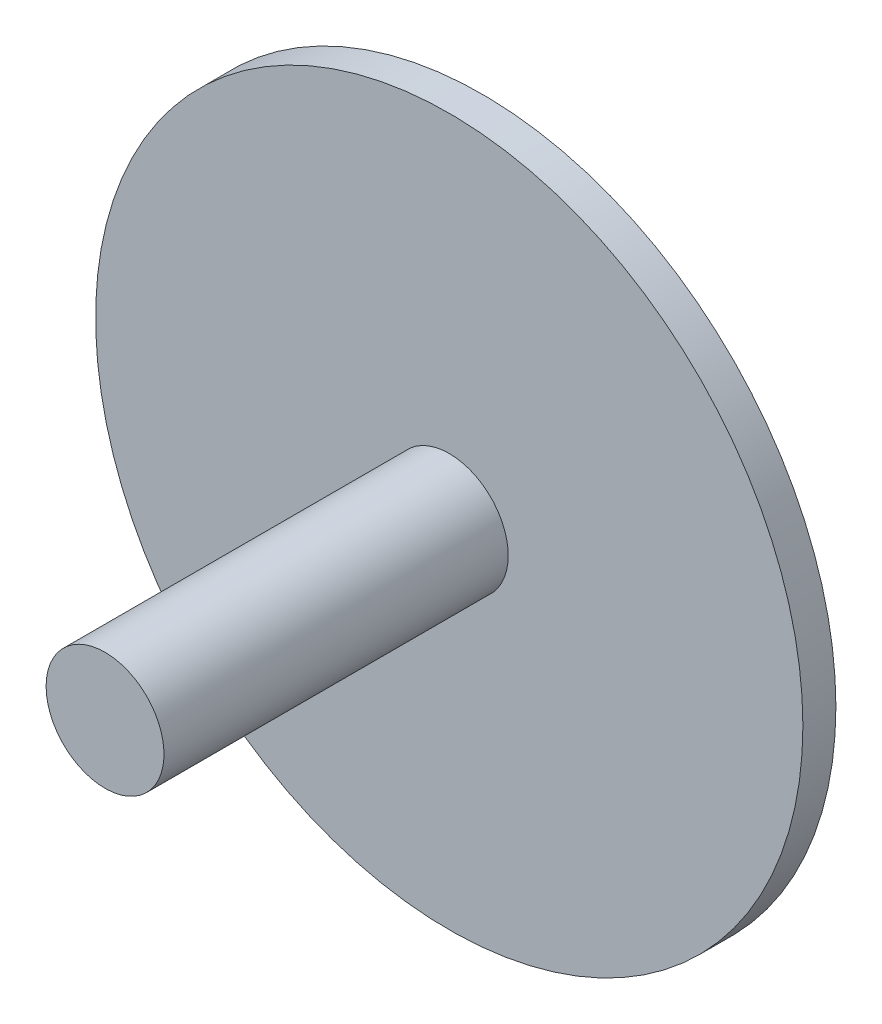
ISO-10303-21;
HEADER;
FILE_DESCRIPTION(('STEP AP214'),'2;1');
FILE_NAME('part.step','',(''),(''),'','','');
FILE_SCHEMA(('AUTOMOTIVE_DESIGN { 1 0 10303 214 1 1 1 1 }'));
ENDSEC;
DATA;
#1=APPLICATION_CONTEXT('core data for automotive mechanical design processes');
#2=APPLICATION_PROTOCOL_DEFINITION('international standard','automotive_design',2000,#1);
#3=PRODUCT_CONTEXT('',#1,'mechanical');
#4=PRODUCT('Part','Part','',(#3));
#5=PRODUCT_RELATED_PRODUCT_CATEGORY('part','',(#4));
#6=PRODUCT_DEFINITION_FORMATION('','',#4);
#7=PRODUCT_DEFINITION_CONTEXT('part definition',#1,'design');
#8=PRODUCT_DEFINITION('design','',#6,#7);
#9=PRODUCT_DEFINITION_SHAPE('','',#8);
#10=(LENGTH_UNIT() NAMED_UNIT(*) SI_UNIT(.MILLI.,.METRE.));
#11=(NAMED_UNIT(*) PLANE_ANGLE_UNIT() SI_UNIT($,.RADIAN.));
#12=(NAMED_UNIT(*) SI_UNIT($,.STERADIAN.) SOLID_ANGLE_UNIT());
#13=UNCERTAINTY_MEASURE_WITH_UNIT(LENGTH_MEASURE(1.E-05),#10,'distance_accuracy_value','');
#14=(GEOMETRIC_REPRESENTATION_CONTEXT(3) GLOBAL_UNCERTAINTY_ASSIGNED_CONTEXT((#13)) GLOBAL_UNIT_ASSIGNED_CONTEXT((#10,
#11,#12)) REPRESENTATION_CONTEXT('',''));
#15=CARTESIAN_POINT('',(0.,0.,0.));
#16=DIRECTION('',(0.,0.,1.));
#17=DIRECTION('',(1.,0.,0.));
#18=AXIS2_PLACEMENT_3D('',#15,#16,#17);
#19=CARTESIAN_POINT('',(5.55625,0.,0.));
#20=DIRECTION('',(0.,0.,-1.));
#21=DIRECTION('',(-1.,0.,0.));
#22=AXIS2_PLACEMENT_3D('',#19,#20,#21);
#23=CYLINDRICAL_SURFACE('',#22,5.55625);
#24=CARTESIAN_POINT('',(5.55625,0.,5.08));
#25=DIRECTION('',(0.,0.,1.));
#26=DIRECTION('',(1.,0.,0.));
#27=AXIS2_PLACEMENT_3D('',#24,#25,#26);
#28=CIRCLE('',#27,5.55625);
#29=CARTESIAN_POINT('',(11.1125,0.,5.08));
#30=VERTEX_POINT('',#29);
#31=EDGE_CURVE('E51',#30,#30,#28,.F.);
#32=ORIENTED_EDGE('',*,*,#31,.T.);
#33=EDGE_LOOP('',(#32));
#34=FACE_BOUND('',#33,.T.);
#35=CARTESIAN_POINT('',(5.55625,0.,0.));
#36=DIRECTION('',(0.,0.,-1.));
#37=DIRECTION('',(-1.,0.,0.));
#38=AXIS2_PLACEMENT_3D('',#35,#36,#37);
#39=CIRCLE('',#38,5.55625);
#40=CARTESIAN_POINT('',(0.,0.,0.));
#41=VERTEX_POINT('',#40);
#42=EDGE_CURVE('E43',#41,#41,#39,.T.);
#43=ORIENTED_EDGE('',*,*,#42,.F.);
#44=EDGE_LOOP('',(#43));
#45=FACE_BOUND('',#44,.T.);
#46=ADVANCED_FACE('F37',(#34,#45),#23,.T.);
#47=CARTESIAN_POINT('',(0.,0.,0.));
#48=DIRECTION('',(0.,0.,-1.));
#49=DIRECTION('',(-1.,0.,0.));
#50=AXIS2_PLACEMENT_3D('',#47,#48,#49);
#51=PLANE('',#50);
#52=ORIENTED_EDGE('',*,*,#42,.T.);
#53=EDGE_LOOP('',(#52));
#54=FACE_BOUND('',#53,.T.);
#55=ADVANCED_FACE('F68',(#54),#51,.T.);
#56=CARTESIAN_POINT('',(5.55625,0.,6.858));
#57=DIRECTION('',(0.,0.,-1.));
#58=DIRECTION('',(-1.,0.,0.));
#59=AXIS2_PLACEMENT_3D('',#56,#57,#58);
#60=CYLINDRICAL_SURFACE('',#59,19.05);
#61=CARTESIAN_POINT('',(5.55625,0.,6.858));
#62=DIRECTION('',(0.,0.,1.));
#63=DIRECTION('',(1.,0.,0.));
#64=AXIS2_PLACEMENT_3D('',#61,#62,#63);
#65=CIRCLE('',#64,19.05);
#66=CARTESIAN_POINT('',(24.60625,0.,6.858));
#67=VERTEX_POINT('',#66);
#68=EDGE_CURVE('E56',#67,#67,#65,.T.);
#69=ORIENTED_EDGE('',*,*,#68,.F.);
#70=EDGE_LOOP('',(#69));
#71=FACE_BOUND('',#70,.T.);
#72=CARTESIAN_POINT('',(5.55625,0.,5.08));
#73=DIRECTION('',(0.,0.,1.));
#74=DIRECTION('',(1.,0.,0.));
#75=AXIS2_PLACEMENT_3D('',#72,#73,#74);
#76=CIRCLE('',#75,19.05);
#77=CARTESIAN_POINT('',(24.60625,0.,5.08));
#78=VERTEX_POINT('',#77);
#79=EDGE_CURVE('E57',#78,#78,#76,.T.);
#80=ORIENTED_EDGE('',*,*,#79,.T.);
#81=EDGE_LOOP('',(#80));
#82=FACE_BOUND('',#81,.T.);
#83=ADVANCED_FACE('F65',(#71,#82),#60,.T.);
#84=CARTESIAN_POINT('',(5.55625,0.,6.858));
#85=DIRECTION('',(0.,0.,1.));
#86=DIRECTION('',(1.,0.,0.));
#87=AXIS2_PLACEMENT_3D('',#84,#85,#86);
#88=PLANE('',#87);
#89=CARTESIAN_POINT('',(5.55625,0.,6.858));
#90=DIRECTION('',(0.,0.,1.));
#91=DIRECTION('',(1.,0.,0.));
#92=AXIS2_PLACEMENT_3D('',#89,#90,#91);
#93=CIRCLE('',#92,3.175);
#94=CARTESIAN_POINT('',(8.73125,0.,6.858));
#95=VERTEX_POINT('',#94);
#96=EDGE_CURVE('E10',#95,#95,#93,.F.);
#97=ORIENTED_EDGE('',*,*,#96,.T.);
#98=EDGE_LOOP('',(#97));
#99=FACE_BOUND('',#98,.T.);
#100=ORIENTED_EDGE('',*,*,#68,.T.);
#101=EDGE_LOOP('',(#100));
#102=FACE_BOUND('',#101,.T.);
#103=ADVANCED_FACE('F63',(#99,#102),#88,.T.);
#104=CARTESIAN_POINT('',(5.55625,0.,5.08));
#105=DIRECTION('',(0.,0.,1.));
#106=DIRECTION('',(1.,0.,0.));
#107=AXIS2_PLACEMENT_3D('',#104,#105,#106);
#108=PLANE('',#107);
#109=ORIENTED_EDGE('',*,*,#31,.F.);
#110=EDGE_LOOP('',(#109));
#111=FACE_BOUND('',#110,.T.);
#112=ORIENTED_EDGE('',*,*,#79,.F.);
#113=EDGE_LOOP('',(#112));
#114=FACE_BOUND('',#113,.T.);
#115=ADVANCED_FACE('F72',(#111,#114),#108,.F.);
#116=CARTESIAN_POINT('',(5.55625,0.,25.4));
#117=DIRECTION('',(0.,0.,1.));
#118=DIRECTION('',(1.,0.,0.));
#119=AXIS2_PLACEMENT_3D('',#116,#117,#118);
#120=PLANE('',#119);
#121=CARTESIAN_POINT('',(5.55625,0.,25.4));
#122=DIRECTION('',(0.,0.,-1.));
#123=DIRECTION('',(-1.,0.,0.));
#124=AXIS2_PLACEMENT_3D('',#121,#122,#123);
#125=CIRCLE('',#124,3.175);
#126=CARTESIAN_POINT('',(2.38125,0.,25.4));
#127=VERTEX_POINT('',#126);
#128=EDGE_CURVE('E47',#127,#127,#125,.T.);
#129=ORIENTED_EDGE('',*,*,#128,.F.);
#130=EDGE_LOOP('',(#129));
#131=FACE_BOUND('',#130,.T.);
#132=ADVANCED_FACE('F74',(#131),#120,.T.);
#133=CARTESIAN_POINT('',(5.55625,0.,0.));
#134=DIRECTION('',(0.,0.,-1.));
#135=DIRECTION('',(-1.,0.,0.));
#136=AXIS2_PLACEMENT_3D('',#133,#134,#135);
#137=CYLINDRICAL_SURFACE('',#136,3.175);
#138=ORIENTED_EDGE('',*,*,#96,.F.);
#139=EDGE_LOOP('',(#138));
#140=FACE_BOUND('',#139,.T.);
#141=ORIENTED_EDGE('',*,*,#128,.T.);
#142=EDGE_LOOP('',(#141));
#143=FACE_BOUND('',#142,.T.);
#144=ADVANCED_FACE('F81',(#140,#143),#137,.T.);
#145=CLOSED_SHELL('',(#46,#55,#83,#103,#115,#132,#144));
#146=MANIFOLD_SOLID_BREP('B2',#145);
#147=ADVANCED_BREP_SHAPE_REPRESENTATION('',(#18,#146),#14);
#148=SHAPE_DEFINITION_REPRESENTATION(#9,#147);
ENDSEC;
END-ISO-10303-21;
